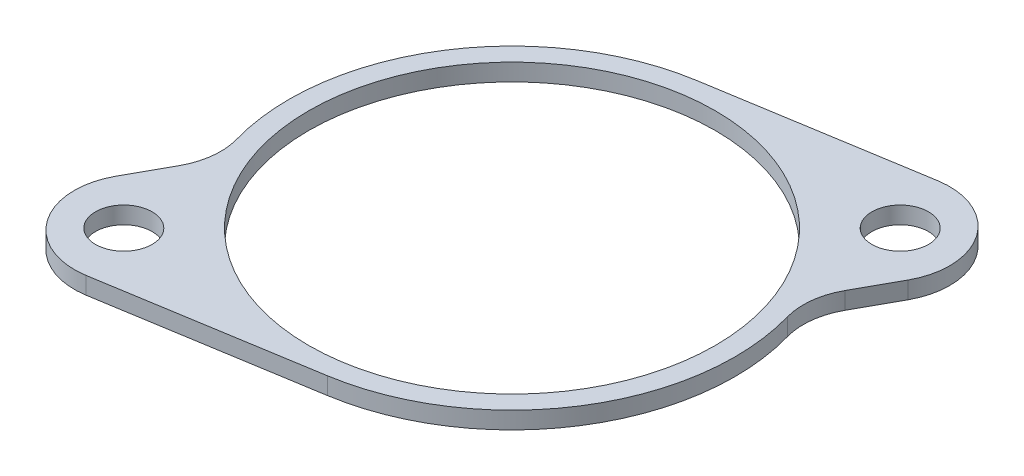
ISO-10303-21;
HEADER;
FILE_DESCRIPTION(('STEP AP214'),'2;1');
FILE_NAME('part.step','',(''),(''),'','','');
FILE_SCHEMA(('AUTOMOTIVE_DESIGN { 1 0 10303 214 1 1 1 1 }'));
ENDSEC;
DATA;
#1=APPLICATION_CONTEXT('core data for automotive mechanical design processes');
#2=APPLICATION_PROTOCOL_DEFINITION('international standard','automotive_design',2000,#1);
#3=PRODUCT_CONTEXT('',#1,'mechanical');
#4=PRODUCT('Part','Part','',(#3));
#5=PRODUCT_RELATED_PRODUCT_CATEGORY('part','',(#4));
#6=PRODUCT_DEFINITION_FORMATION('','',#4);
#7=PRODUCT_DEFINITION_CONTEXT('part definition',#1,'design');
#8=PRODUCT_DEFINITION('design','',#6,#7);
#9=PRODUCT_DEFINITION_SHAPE('','',#8);
#10=(LENGTH_UNIT() NAMED_UNIT(*) SI_UNIT(.MILLI.,.METRE.));
#11=(NAMED_UNIT(*) PLANE_ANGLE_UNIT() SI_UNIT($,.RADIAN.));
#12=(NAMED_UNIT(*) SI_UNIT($,.STERADIAN.) SOLID_ANGLE_UNIT());
#13=UNCERTAINTY_MEASURE_WITH_UNIT(LENGTH_MEASURE(1.E-05),#10,'distance_accuracy_value','');
#14=(GEOMETRIC_REPRESENTATION_CONTEXT(3) GLOBAL_UNCERTAINTY_ASSIGNED_CONTEXT((#13)) GLOBAL_UNIT_ASSIGNED_CONTEXT((#10,
#11,#12)) REPRESENTATION_CONTEXT('',''));
#15=CARTESIAN_POINT('',(0.,0.,0.));
#16=DIRECTION('',(0.,0.,1.));
#17=DIRECTION('',(1.,0.,0.));
#18=AXIS2_PLACEMENT_3D('',#15,#16,#17);
#19=CARTESIAN_POINT('',(0.,1.,0.));
#20=DIRECTION('',(0.,1.,0.));
#21=DIRECTION('',(0.,0.,1.));
#22=AXIS2_PLACEMENT_3D('',#19,#20,#21);
#23=PLANE('',#22);
#24=CARTESIAN_POINT('',(11.3137084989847,1.,-11.3137084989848));
#25=DIRECTION('',(0.,1.,0.));
#26=DIRECTION('',(0.,0.,1.));
#27=AXIS2_PLACEMENT_3D('',#24,#25,#26);
#28=CIRCLE('',#27,1.65);
#29=CARTESIAN_POINT('',(11.3137084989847,1.,-9.66370849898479));
#30=VERTEX_POINT('',#29);
#31=EDGE_CURVE('E220',#30,#30,#28,.T.);
#32=ORIENTED_EDGE('',*,*,#31,.F.);
#33=EDGE_LOOP('',(#32));
#34=FACE_BOUND('',#33,.T.);
#35=DIRECTION('',(0.482923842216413,0.,-0.875662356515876));
#36=VECTOR('',#35,1.);
#37=CARTESIAN_POINT('',(12.,1.,-5.));
#38=LINE('',#37,#36);
#39=CARTESIAN_POINT('',(12.8569307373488,1.,-6.55383090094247));
#40=VERTEX_POINT('',#39);
#41=CARTESIAN_POINT('',(14.1624216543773,1.,-8.92101419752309));
#42=VERTEX_POINT('',#41);
#43=EDGE_CURVE('E130',#40,#42,#38,.T.);
#44=ORIENTED_EDGE('',*,*,#43,.T.);
#45=CARTESIAN_POINT('',(10.6597722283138,1.,-10.8527095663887));
#46=DIRECTION('',(0.,1.,0.));
#47=DIRECTION('',(0.,0.,1.));
#48=AXIS2_PLACEMENT_3D('',#45,#46,#47);
#49=CIRCLE('',#48,4.);
#50=CARTESIAN_POINT('',(10.0174117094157,1.,-14.8007942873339));
#51=VERTEX_POINT('',#50);
#52=EDGE_CURVE('E126',#42,#51,#49,.T.);
#53=ORIENTED_EDGE('',*,*,#52,.T.);
#54=DIRECTION('',(-0.9870211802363,0.,0.160590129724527));
#55=VECTOR('',#54,1.);
#56=CARTESIAN_POINT('',(18.1333296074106,1.,-16.1212687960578));
#57=LINE('',#56,#55);
#58=CARTESIAN_POINT('',(-2.08767168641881,1.,-12.8312753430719));
#59=VERTEX_POINT('',#58);
#60=EDGE_CURVE('E118',#51,#59,#57,.T.);
#61=ORIENTED_EDGE('',*,*,#60,.T.);
#62=CARTESIAN_POINT('',(0.,1.,0.));
#63=DIRECTION('',(0.,1.,0.));
#64=DIRECTION('',(0.,0.,1.));
#65=AXIS2_PLACEMENT_3D('',#62,#63,#64);
#66=CIRCLE('',#65,13.);
#67=CARTESIAN_POINT('',(-12.5102671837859,1.,3.53457423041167));
#68=VERTEX_POINT('',#67);
#69=EDGE_CURVE('E123',#59,#68,#66,.T.);
#70=ORIENTED_EDGE('',*,*,#69,.T.);
#71=CARTESIAN_POINT('',(-16.3595801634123,1.,4.6221355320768));
#72=DIRECTION('',(0.,1.,0.));
#73=DIRECTION('',(0.,0.,1.));
#74=AXIS2_PLACEMENT_3D('',#71,#72,#73);
#75=CIRCLE('',#74,4.);
#76=CARTESIAN_POINT('',(-12.8569307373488,1.,6.55383090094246));
#77=VERTEX_POINT('',#76);
#78=EDGE_CURVE('E194',#68,#77,#75,.F.);
#79=ORIENTED_EDGE('',*,*,#78,.T.);
#80=DIRECTION('',(-0.482923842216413,0.,0.875662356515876));
#81=VECTOR('',#80,1.);
#82=CARTESIAN_POINT('',(-12.,1.,5.));
#83=LINE('',#82,#81);
#84=CARTESIAN_POINT('',(-14.1624216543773,1.,8.92101419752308));
#85=VERTEX_POINT('',#84);
#86=EDGE_CURVE('E146',#77,#85,#83,.T.);
#87=ORIENTED_EDGE('',*,*,#86,.T.);
#88=CARTESIAN_POINT('',(-10.6597722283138,1.,10.8527095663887));
#89=DIRECTION('',(0.,1.,0.));
#90=DIRECTION('',(0.,0.,1.));
#91=AXIS2_PLACEMENT_3D('',#88,#89,#90);
#92=CIRCLE('',#91,4.);
#93=CARTESIAN_POINT('',(-10.0174117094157,1.,14.8007942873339));
#94=VERTEX_POINT('',#93);
#95=EDGE_CURVE('E56',#85,#94,#92,.T.);
#96=ORIENTED_EDGE('',*,*,#95,.T.);
#97=DIRECTION('',(0.987021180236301,0.,-0.160590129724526));
#98=VECTOR('',#97,1.);
#99=CARTESIAN_POINT('',(-18.1333296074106,1.,16.1212687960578));
#100=LINE('',#99,#98);
#101=CARTESIAN_POINT('',(2.08767168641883,1.,12.8312753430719));
#102=VERTEX_POINT('',#101);
#103=EDGE_CURVE('E148',#94,#102,#100,.T.);
#104=ORIENTED_EDGE('',*,*,#103,.T.);
#105=CARTESIAN_POINT('',(0.,1.,0.));
#106=DIRECTION('',(0.,1.,0.));
#107=DIRECTION('',(0.,0.,1.));
#108=AXIS2_PLACEMENT_3D('',#105,#106,#107);
#109=CIRCLE('',#108,13.);
#110=CARTESIAN_POINT('',(12.5102671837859,1.,-3.53457423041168));
#111=VERTEX_POINT('',#110);
#112=EDGE_CURVE('E168',#102,#111,#109,.T.);
#113=ORIENTED_EDGE('',*,*,#112,.T.);
#114=CARTESIAN_POINT('',(16.3595801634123,1.,-4.62213553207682));
#115=DIRECTION('',(0.,1.,0.));
#116=DIRECTION('',(0.,0.,1.));
#117=AXIS2_PLACEMENT_3D('',#114,#115,#116);
#118=CIRCLE('',#117,4.);
#119=EDGE_CURVE('E11',#111,#40,#118,.F.);
#120=ORIENTED_EDGE('',*,*,#119,.T.);
#121=EDGE_LOOP('',(#44,#53,#61,#70,#79,#87,#96,#104,#113,#120));
#122=FACE_BOUND('',#121,.T.);
#123=CARTESIAN_POINT('',(0.,1.,0.));
#124=DIRECTION('',(0.,1.,0.));
#125=DIRECTION('',(0.,0.,1.));
#126=AXIS2_PLACEMENT_3D('',#123,#124,#125);
#127=CIRCLE('',#126,11.85);
#128=CARTESIAN_POINT('',(0.,1.,11.85));
#129=VERTEX_POINT('',#128);
#130=EDGE_CURVE('E157',#129,#129,#127,.T.);
#131=ORIENTED_EDGE('',*,*,#130,.F.);
#132=EDGE_LOOP('',(#131));
#133=FACE_BOUND('',#132,.T.);
#134=CARTESIAN_POINT('',(-11.3137084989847,1.,11.3137084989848));
#135=DIRECTION('',(0.,1.,0.));
#136=DIRECTION('',(0.,0.,1.));
#137=AXIS2_PLACEMENT_3D('',#134,#135,#136);
#138=CIRCLE('',#137,1.65);
#139=CARTESIAN_POINT('',(-11.3137084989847,1.,12.9637084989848));
#140=VERTEX_POINT('',#139);
#141=EDGE_CURVE('E226',#140,#140,#138,.T.);
#142=ORIENTED_EDGE('',*,*,#141,.F.);
#143=EDGE_LOOP('',(#142));
#144=FACE_BOUND('',#143,.T.);
#145=ADVANCED_FACE('F41',(#34,#122,#133,#144),#23,.T.);
#146=CARTESIAN_POINT('',(0.,0.,0.));
#147=DIRECTION('',(0.,1.,0.));
#148=DIRECTION('',(0.,0.,1.));
#149=AXIS2_PLACEMENT_3D('',#146,#147,#148);
#150=PLANE('',#149);
#151=DIRECTION('',(-0.9870211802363,0.,0.160590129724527));
#152=VECTOR('',#151,1.);
#153=CARTESIAN_POINT('',(18.1333296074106,0.,-16.1212687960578));
#154=LINE('',#153,#152);
#155=CARTESIAN_POINT('',(10.0174117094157,0.,-14.8007942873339));
#156=VERTEX_POINT('',#155);
#157=CARTESIAN_POINT('',(-2.08767168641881,0.,-12.8312753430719));
#158=VERTEX_POINT('',#157);
#159=EDGE_CURVE('E136',#156,#158,#154,.T.);
#160=ORIENTED_EDGE('',*,*,#159,.F.);
#161=CARTESIAN_POINT('',(10.6597722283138,0.,-10.8527095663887));
#162=DIRECTION('',(0.,1.,0.));
#163=DIRECTION('',(0.,0.,1.));
#164=AXIS2_PLACEMENT_3D('',#161,#162,#163);
#165=CIRCLE('',#164,4.);
#166=CARTESIAN_POINT('',(14.1624216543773,0.,-8.92101419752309));
#167=VERTEX_POINT('',#166);
#168=EDGE_CURVE('E186',#156,#167,#165,.F.);
#169=ORIENTED_EDGE('',*,*,#168,.T.);
#170=DIRECTION('',(0.482923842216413,0.,-0.875662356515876));
#171=VECTOR('',#170,1.);
#172=CARTESIAN_POINT('',(12.,0.,-5.));
#173=LINE('',#172,#171);
#174=CARTESIAN_POINT('',(12.8569307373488,0.,-6.55383090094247));
#175=VERTEX_POINT('',#174);
#176=EDGE_CURVE('E156',#175,#167,#173,.T.);
#177=ORIENTED_EDGE('',*,*,#176,.F.);
#178=CARTESIAN_POINT('',(16.3595801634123,0.,-4.62213553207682));
#179=DIRECTION('',(0.,1.,0.));
#180=DIRECTION('',(0.,0.,1.));
#181=AXIS2_PLACEMENT_3D('',#178,#179,#180);
#182=CIRCLE('',#181,4.);
#183=CARTESIAN_POINT('',(12.5102671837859,0.,-3.53457423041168));
#184=VERTEX_POINT('',#183);
#185=EDGE_CURVE('E49',#175,#184,#182,.T.);
#186=ORIENTED_EDGE('',*,*,#185,.T.);
#187=CARTESIAN_POINT('',(0.,0.,0.));
#188=DIRECTION('',(0.,1.,0.));
#189=DIRECTION('',(0.,0.,1.));
#190=AXIS2_PLACEMENT_3D('',#187,#188,#189);
#191=CIRCLE('',#190,13.);
#192=CARTESIAN_POINT('',(2.08767168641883,0.,12.8312753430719));
#193=VERTEX_POINT('',#192);
#194=EDGE_CURVE('E153',#193,#184,#191,.T.);
#195=ORIENTED_EDGE('',*,*,#194,.F.);
#196=DIRECTION('',(0.987021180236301,0.,-0.160590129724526));
#197=VECTOR('',#196,1.);
#198=CARTESIAN_POINT('',(-18.1333296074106,0.,16.1212687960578));
#199=LINE('',#198,#197);
#200=CARTESIAN_POINT('',(-10.0174117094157,0.,14.8007942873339));
#201=VERTEX_POINT('',#200);
#202=EDGE_CURVE('E166',#201,#193,#199,.T.);
#203=ORIENTED_EDGE('',*,*,#202,.F.);
#204=CARTESIAN_POINT('',(-10.6597722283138,0.,10.8527095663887));
#205=DIRECTION('',(0.,1.,0.));
#206=DIRECTION('',(0.,0.,1.));
#207=AXIS2_PLACEMENT_3D('',#204,#205,#206);
#208=CIRCLE('',#207,4.);
#209=CARTESIAN_POINT('',(-14.1624216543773,0.,8.92101419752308));
#210=VERTEX_POINT('',#209);
#211=EDGE_CURVE('E64',#201,#210,#208,.F.);
#212=ORIENTED_EDGE('',*,*,#211,.T.);
#213=DIRECTION('',(-0.482923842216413,0.,0.875662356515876));
#214=VECTOR('',#213,1.);
#215=CARTESIAN_POINT('',(-12.,0.,5.));
#216=LINE('',#215,#214);
#217=CARTESIAN_POINT('',(-12.8569307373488,0.,6.55383090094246));
#218=VERTEX_POINT('',#217);
#219=EDGE_CURVE('E163',#218,#210,#216,.T.);
#220=ORIENTED_EDGE('',*,*,#219,.F.);
#221=CARTESIAN_POINT('',(-16.3595801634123,0.,4.6221355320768));
#222=DIRECTION('',(0.,1.,0.));
#223=DIRECTION('',(0.,0.,1.));
#224=AXIS2_PLACEMENT_3D('',#221,#222,#223);
#225=CIRCLE('',#224,4.);
#226=CARTESIAN_POINT('',(-12.5102671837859,0.,3.53457423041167));
#227=VERTEX_POINT('',#226);
#228=EDGE_CURVE('E192',#218,#227,#225,.T.);
#229=ORIENTED_EDGE('',*,*,#228,.T.);
#230=CARTESIAN_POINT('',(0.,0.,0.));
#231=DIRECTION('',(0.,1.,0.));
#232=DIRECTION('',(0.,0.,1.));
#233=AXIS2_PLACEMENT_3D('',#230,#231,#232);
#234=CIRCLE('',#233,13.);
#235=EDGE_CURVE('E161',#158,#227,#234,.T.);
#236=ORIENTED_EDGE('',*,*,#235,.F.);
#237=EDGE_LOOP('',(#160,#169,#177,#186,#195,#203,#212,#220,#229,#236));
#238=FACE_BOUND('',#237,.T.);
#239=CARTESIAN_POINT('',(0.,0.,0.));
#240=DIRECTION('',(0.,1.,0.));
#241=DIRECTION('',(0.,0.,1.));
#242=AXIS2_PLACEMENT_3D('',#239,#240,#241);
#243=CIRCLE('',#242,11.85);
#244=CARTESIAN_POINT('',(0.,0.,11.85));
#245=VERTEX_POINT('',#244);
#246=EDGE_CURVE('E217',#245,#245,#243,.T.);
#247=ORIENTED_EDGE('',*,*,#246,.T.);
#248=EDGE_LOOP('',(#247));
#249=FACE_BOUND('',#248,.T.);
#250=CARTESIAN_POINT('',(11.3137084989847,0.,-11.3137084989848));
#251=DIRECTION('',(0.,1.,0.));
#252=DIRECTION('',(0.,0.,1.));
#253=AXIS2_PLACEMENT_3D('',#250,#251,#252);
#254=CIRCLE('',#253,1.65);
#255=CARTESIAN_POINT('',(11.3137084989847,0.,-9.66370849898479));
#256=VERTEX_POINT('',#255);
#257=EDGE_CURVE('E223',#256,#256,#254,.T.);
#258=ORIENTED_EDGE('',*,*,#257,.T.);
#259=EDGE_LOOP('',(#258));
#260=FACE_BOUND('',#259,.T.);
#261=CARTESIAN_POINT('',(-11.3137084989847,0.,11.3137084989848));
#262=DIRECTION('',(0.,1.,0.));
#263=DIRECTION('',(0.,0.,1.));
#264=AXIS2_PLACEMENT_3D('',#261,#262,#263);
#265=CIRCLE('',#264,1.65);
#266=CARTESIAN_POINT('',(-11.3137084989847,0.,12.9637084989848));
#267=VERTEX_POINT('',#266);
#268=EDGE_CURVE('E229',#267,#267,#265,.T.);
#269=ORIENTED_EDGE('',*,*,#268,.T.);
#270=EDGE_LOOP('',(#269));
#271=FACE_BOUND('',#270,.T.);
#272=ADVANCED_FACE('F198',(#238,#249,#260,#271),#150,.F.);
#273=CARTESIAN_POINT('',(0.,1.,0.));
#274=DIRECTION('',(0.,-1.,0.));
#275=DIRECTION('',(0.,0.,-1.));
#276=AXIS2_PLACEMENT_3D('',#273,#274,#275);
#277=CYLINDRICAL_SURFACE('',#276,13.);
#278=ORIENTED_EDGE('',*,*,#194,.T.);
#279=DIRECTION('',(0.,-1.,0.));
#280=VECTOR('',#279,1.);
#281=CARTESIAN_POINT('',(12.5102671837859,1.,-3.53457423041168));
#282=LINE('',#281,#280);
#283=EDGE_CURVE('E181',#184,#111,#282,.F.);
#284=ORIENTED_EDGE('',*,*,#283,.T.);
#285=ORIENTED_EDGE('',*,*,#112,.F.);
#286=DIRECTION('',(0.,-1.,0.));
#287=VECTOR('',#286,1.);
#288=CARTESIAN_POINT('',(2.08767168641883,1.,12.8312753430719));
#289=LINE('',#288,#287);
#290=EDGE_CURVE('E141',#102,#193,#289,.T.);
#291=ORIENTED_EDGE('',*,*,#290,.T.);
#292=EDGE_LOOP('',(#278,#284,#285,#291));
#293=FACE_BOUND('',#292,.T.);
#294=ADVANCED_FACE('F205',(#293),#277,.T.);
#295=CARTESIAN_POINT('',(12.,1.,-5.));
#296=DIRECTION('',(-0.875662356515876,0.,-0.482923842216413));
#297=DIRECTION('',(-0.482923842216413,0.,0.875662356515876));
#298=AXIS2_PLACEMENT_3D('',#295,#296,#297);
#299=PLANE('',#298);
#300=ORIENTED_EDGE('',*,*,#43,.F.);
#301=DIRECTION('',(0.,1.,0.));
#302=VECTOR('',#301,1.);
#303=CARTESIAN_POINT('',(12.8569307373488,0.,-6.55383090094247));
#304=LINE('',#303,#302);
#305=EDGE_CURVE('E178',#40,#175,#304,.F.);
#306=ORIENTED_EDGE('',*,*,#305,.T.);
#307=ORIENTED_EDGE('',*,*,#176,.T.);
#308=DIRECTION('',(0.,-1.,0.));
#309=VECTOR('',#308,1.);
#310=CARTESIAN_POINT('',(14.1624216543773,1.,-8.92101419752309));
#311=LINE('',#310,#309);
#312=EDGE_CURVE('E176',#167,#42,#311,.F.);
#313=ORIENTED_EDGE('',*,*,#312,.T.);
#314=EDGE_LOOP('',(#300,#306,#307,#313));
#315=FACE_BOUND('',#314,.T.);
#316=ADVANCED_FACE('F213',(#315),#299,.F.);
#317=CARTESIAN_POINT('',(18.1333296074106,1.,-16.1212687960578));
#318=DIRECTION('',(0.160590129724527,0.,0.9870211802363));
#319=DIRECTION('',(0.9870211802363,0.,-0.160590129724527));
#320=AXIS2_PLACEMENT_3D('',#317,#318,#319);
#321=PLANE('',#320);
#322=ORIENTED_EDGE('',*,*,#60,.F.);
#323=DIRECTION('',(0.,-1.,0.));
#324=VECTOR('',#323,1.);
#325=CARTESIAN_POINT('',(10.0174117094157,1.,-14.8007942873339));
#326=LINE('',#325,#324);
#327=EDGE_CURVE('E183',#51,#156,#326,.T.);
#328=ORIENTED_EDGE('',*,*,#327,.T.);
#329=ORIENTED_EDGE('',*,*,#159,.T.);
#330=DIRECTION('',(0.,-1.,0.));
#331=VECTOR('',#330,1.);
#332=CARTESIAN_POINT('',(-2.08767168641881,1.,-12.8312753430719));
#333=LINE('',#332,#331);
#334=EDGE_CURVE('E133',#59,#158,#333,.T.);
#335=ORIENTED_EDGE('',*,*,#334,.F.);
#336=EDGE_LOOP('',(#322,#328,#329,#335));
#337=FACE_BOUND('',#336,.T.);
#338=ADVANCED_FACE('F134',(#337),#321,.F.);
#339=CARTESIAN_POINT('',(0.,1.,0.));
#340=DIRECTION('',(0.,-1.,0.));
#341=DIRECTION('',(0.,0.,-1.));
#342=AXIS2_PLACEMENT_3D('',#339,#340,#341);
#343=CYLINDRICAL_SURFACE('',#342,13.);
#344=ORIENTED_EDGE('',*,*,#235,.T.);
#345=DIRECTION('',(0.,-1.,0.));
#346=VECTOR('',#345,1.);
#347=CARTESIAN_POINT('',(-12.5102671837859,1.,3.53457423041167));
#348=LINE('',#347,#346);
#349=EDGE_CURVE('E145',#227,#68,#348,.F.);
#350=ORIENTED_EDGE('',*,*,#349,.T.);
#351=ORIENTED_EDGE('',*,*,#69,.F.);
#352=ORIENTED_EDGE('',*,*,#334,.T.);
#353=EDGE_LOOP('',(#344,#350,#351,#352));
#354=FACE_BOUND('',#353,.T.);
#355=ADVANCED_FACE('F143',(#354),#343,.T.);
#356=CARTESIAN_POINT('',(-12.,1.,5.));
#357=DIRECTION('',(0.875662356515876,0.,0.482923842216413));
#358=DIRECTION('',(0.482923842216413,0.,-0.875662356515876));
#359=AXIS2_PLACEMENT_3D('',#356,#357,#358);
#360=PLANE('',#359);
#361=ORIENTED_EDGE('',*,*,#86,.F.);
#362=DIRECTION('',(0.,1.,0.));
#363=VECTOR('',#362,1.);
#364=CARTESIAN_POINT('',(-12.8569307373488,0.,6.55383090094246));
#365=LINE('',#364,#363);
#366=EDGE_CURVE('E172',#77,#218,#365,.F.);
#367=ORIENTED_EDGE('',*,*,#366,.T.);
#368=ORIENTED_EDGE('',*,*,#219,.T.);
#369=DIRECTION('',(0.,-1.,0.));
#370=VECTOR('',#369,1.);
#371=CARTESIAN_POINT('',(-14.1624216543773,1.,8.92101419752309));
#372=LINE('',#371,#370);
#373=EDGE_CURVE('E140',#210,#85,#372,.F.);
#374=ORIENTED_EDGE('',*,*,#373,.T.);
#375=EDGE_LOOP('',(#361,#367,#368,#374));
#376=FACE_BOUND('',#375,.T.);
#377=ADVANCED_FACE('F254',(#376),#360,.F.);
#378=CARTESIAN_POINT('',(-18.1333296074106,1.,16.1212687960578));
#379=DIRECTION('',(-0.160590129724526,0.,-0.987021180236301));
#380=DIRECTION('',(-0.987021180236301,0.,0.160590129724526));
#381=AXIS2_PLACEMENT_3D('',#378,#379,#380);
#382=PLANE('',#381);
#383=ORIENTED_EDGE('',*,*,#103,.F.);
#384=DIRECTION('',(0.,-1.,0.));
#385=VECTOR('',#384,1.);
#386=CARTESIAN_POINT('',(-10.0174117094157,1.,14.8007942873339));
#387=LINE('',#386,#385);
#388=EDGE_CURVE('E190',#94,#201,#387,.T.);
#389=ORIENTED_EDGE('',*,*,#388,.T.);
#390=ORIENTED_EDGE('',*,*,#202,.T.);
#391=ORIENTED_EDGE('',*,*,#290,.F.);
#392=EDGE_LOOP('',(#383,#389,#390,#391));
#393=FACE_BOUND('',#392,.T.);
#394=ADVANCED_FACE('F251',(#393),#382,.F.);
#395=CARTESIAN_POINT('',(0.,1.,0.));
#396=DIRECTION('',(0.,-1.,0.));
#397=DIRECTION('',(0.,0.,-1.));
#398=AXIS2_PLACEMENT_3D('',#395,#396,#397);
#399=CYLINDRICAL_SURFACE('',#398,11.85);
#400=ORIENTED_EDGE('',*,*,#130,.T.);
#401=EDGE_LOOP('',(#400));
#402=FACE_BOUND('',#401,.T.);
#403=ORIENTED_EDGE('',*,*,#246,.F.);
#404=EDGE_LOOP('',(#403));
#405=FACE_BOUND('',#404,.T.);
#406=ADVANCED_FACE('F248',(#402,#405),#399,.F.);
#407=CARTESIAN_POINT('',(11.3137084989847,1.,-11.3137084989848));
#408=DIRECTION('',(0.,-1.,0.));
#409=DIRECTION('',(0.,0.,-1.));
#410=AXIS2_PLACEMENT_3D('',#407,#408,#409);
#411=CYLINDRICAL_SURFACE('',#410,1.65);
#412=ORIENTED_EDGE('',*,*,#31,.T.);
#413=EDGE_LOOP('',(#412));
#414=FACE_BOUND('',#413,.T.);
#415=ORIENTED_EDGE('',*,*,#257,.F.);
#416=EDGE_LOOP('',(#415));
#417=FACE_BOUND('',#416,.T.);
#418=ADVANCED_FACE('F308',(#414,#417),#411,.F.);
#419=CARTESIAN_POINT('',(-11.3137084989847,1.,11.3137084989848));
#420=DIRECTION('',(0.,-1.,0.));
#421=DIRECTION('',(0.,0.,-1.));
#422=AXIS2_PLACEMENT_3D('',#419,#420,#421);
#423=CYLINDRICAL_SURFACE('',#422,1.65);
#424=ORIENTED_EDGE('',*,*,#141,.T.);
#425=EDGE_LOOP('',(#424));
#426=FACE_BOUND('',#425,.T.);
#427=ORIENTED_EDGE('',*,*,#268,.F.);
#428=EDGE_LOOP('',(#427));
#429=FACE_BOUND('',#428,.T.);
#430=ADVANCED_FACE('F235',(#426,#429),#423,.F.);
#431=CARTESIAN_POINT('',(-16.3595801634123,1.,4.6221355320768));
#432=DIRECTION('',(0.,-1.,0.));
#433=DIRECTION('',(0.,0.,-1.));
#434=AXIS2_PLACEMENT_3D('',#431,#432,#433);
#435=CYLINDRICAL_SURFACE('',#434,4.);
#436=ORIENTED_EDGE('',*,*,#78,.F.);
#437=ORIENTED_EDGE('',*,*,#349,.F.);
#438=ORIENTED_EDGE('',*,*,#228,.F.);
#439=ORIENTED_EDGE('',*,*,#366,.F.);
#440=EDGE_LOOP('',(#436,#437,#438,#439));
#441=FACE_BOUND('',#440,.T.);
#442=ADVANCED_FACE('F267',(#441),#435,.F.);
#443=CARTESIAN_POINT('',(16.3595801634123,1.,-4.62213553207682));
#444=DIRECTION('',(0.,-1.,0.));
#445=DIRECTION('',(0.,0.,-1.));
#446=AXIS2_PLACEMENT_3D('',#443,#444,#445);
#447=CYLINDRICAL_SURFACE('',#446,4.);
#448=ORIENTED_EDGE('',*,*,#119,.F.);
#449=ORIENTED_EDGE('',*,*,#283,.F.);
#450=ORIENTED_EDGE('',*,*,#185,.F.);
#451=ORIENTED_EDGE('',*,*,#305,.F.);
#452=EDGE_LOOP('',(#448,#449,#450,#451));
#453=FACE_BOUND('',#452,.T.);
#454=ADVANCED_FACE('F210',(#453),#447,.F.);
#455=CARTESIAN_POINT('',(10.6597722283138,1.,-10.8527095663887));
#456=DIRECTION('',(0.,-1.,0.));
#457=DIRECTION('',(0.,0.,-1.));
#458=AXIS2_PLACEMENT_3D('',#455,#456,#457);
#459=CYLINDRICAL_SURFACE('',#458,4.);
#460=ORIENTED_EDGE('',*,*,#52,.F.);
#461=ORIENTED_EDGE('',*,*,#312,.F.);
#462=ORIENTED_EDGE('',*,*,#168,.F.);
#463=ORIENTED_EDGE('',*,*,#327,.F.);
#464=EDGE_LOOP('',(#460,#461,#462,#463));
#465=FACE_BOUND('',#464,.T.);
#466=ADVANCED_FACE('F272',(#465),#459,.T.);
#467=CARTESIAN_POINT('',(-10.6597722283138,1.,10.8527095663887));
#468=DIRECTION('',(0.,-1.,0.));
#469=DIRECTION('',(0.,0.,-1.));
#470=AXIS2_PLACEMENT_3D('',#467,#468,#469);
#471=CYLINDRICAL_SURFACE('',#470,4.);
#472=ORIENTED_EDGE('',*,*,#95,.F.);
#473=ORIENTED_EDGE('',*,*,#373,.F.);
#474=ORIENTED_EDGE('',*,*,#211,.F.);
#475=ORIENTED_EDGE('',*,*,#388,.F.);
#476=EDGE_LOOP('',(#472,#473,#474,#475));
#477=FACE_BOUND('',#476,.T.);
#478=ADVANCED_FACE('F43',(#477),#471,.T.);
#479=CLOSED_SHELL('',(#145,#272,#294,#316,#338,#355,#377,#394,#406,#418,#430,#442,#454,#466,#478));
#480=MANIFOLD_SOLID_BREP('B2',#479);
#481=ADVANCED_BREP_SHAPE_REPRESENTATION('',(#18,#480),#14);
#482=SHAPE_DEFINITION_REPRESENTATION(#9,#481);
ENDSEC;
END-ISO-10303-21;
